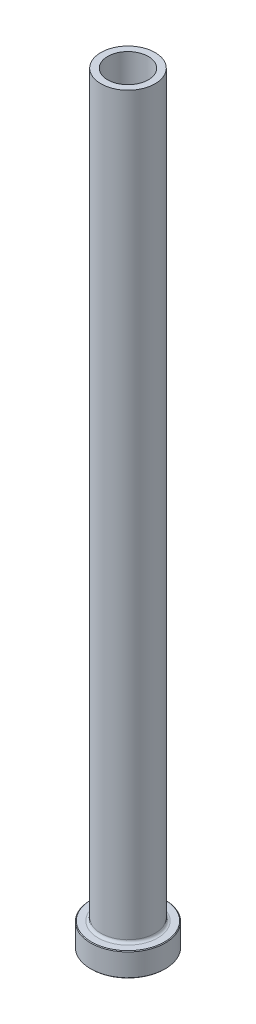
ISO-10303-21;
HEADER;
FILE_DESCRIPTION(('STEP AP214'),'2;1');
FILE_NAME('part.step','',(''),(''),'','','');
FILE_SCHEMA(('AUTOMOTIVE_DESIGN { 1 0 10303 214 1 1 1 1 }'));
ENDSEC;
DATA;
#1=APPLICATION_CONTEXT('core data for automotive mechanical design processes');
#2=APPLICATION_PROTOCOL_DEFINITION('international standard','automotive_design',2000,#1);
#3=PRODUCT_CONTEXT('',#1,'mechanical');
#4=PRODUCT('Part','Part','',(#3));
#5=PRODUCT_RELATED_PRODUCT_CATEGORY('part','',(#4));
#6=PRODUCT_DEFINITION_FORMATION('','',#4);
#7=PRODUCT_DEFINITION_CONTEXT('part definition',#1,'design');
#8=PRODUCT_DEFINITION('design','',#6,#7);
#9=PRODUCT_DEFINITION_SHAPE('','',#8);
#10=(LENGTH_UNIT() NAMED_UNIT(*) SI_UNIT(.MILLI.,.METRE.));
#11=(NAMED_UNIT(*) PLANE_ANGLE_UNIT() SI_UNIT($,.RADIAN.));
#12=(NAMED_UNIT(*) SI_UNIT($,.STERADIAN.) SOLID_ANGLE_UNIT());
#13=UNCERTAINTY_MEASURE_WITH_UNIT(LENGTH_MEASURE(1.E-05),#10,'distance_accuracy_value','');
#14=(GEOMETRIC_REPRESENTATION_CONTEXT(3) GLOBAL_UNCERTAINTY_ASSIGNED_CONTEXT((#13)) GLOBAL_UNIT_ASSIGNED_CONTEXT((#10,
#11,#12)) REPRESENTATION_CONTEXT('',''));
#15=CARTESIAN_POINT('',(0.,0.,0.));
#16=DIRECTION('',(0.,0.,1.));
#17=DIRECTION('',(1.,0.,0.));
#18=AXIS2_PLACEMENT_3D('',#15,#16,#17);
#19=CARTESIAN_POINT('',(0.,92.1876809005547,0.));
#20=DIRECTION('',(0.,1.,0.));
#21=DIRECTION('',(0.,0.,1.));
#22=AXIS2_PLACEMENT_3D('',#19,#20,#21);
#23=CYLINDRICAL_SURFACE('',#22,6.00000000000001);
#24=CARTESIAN_POINT('',(0.,225.,0.));
#25=DIRECTION('',(0.,1.,0.));
#26=DIRECTION('',(0.,0.,1.));
#27=AXIS2_PLACEMENT_3D('',#24,#25,#26);
#28=CIRCLE('',#27,6.00000000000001);
#29=CARTESIAN_POINT('',(0.,225.,6.00000000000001));
#30=VERTEX_POINT('',#29);
#31=EDGE_CURVE('E62',#30,#30,#28,.T.);
#32=ORIENTED_EDGE('',*,*,#31,.T.);
#33=EDGE_LOOP('',(#32));
#34=FACE_BOUND('',#33,.T.);
#35=CARTESIAN_POINT('',(0.,170.,0.));
#36=DIRECTION('',(0.,1.,0.));
#37=DIRECTION('',(0.,0.,1.));
#38=AXIS2_PLACEMENT_3D('',#35,#36,#37);
#39=CIRCLE('',#38,6.00000000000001);
#40=CARTESIAN_POINT('',(0.,170.,6.00000000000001));
#41=VERTEX_POINT('',#40);
#42=EDGE_CURVE('E71',#41,#41,#39,.T.);
#43=ORIENTED_EDGE('',*,*,#42,.F.);
#44=EDGE_LOOP('',(#43));
#45=FACE_BOUND('',#44,.T.);
#46=ADVANCED_FACE('F30',(#34,#45),#23,.F.);
#47=CARTESIAN_POINT('',(-6.00000000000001,225.,0.));
#48=DIRECTION('',(0.,1.,0.));
#49=DIRECTION('',(0.,0.,1.));
#50=AXIS2_PLACEMENT_3D('',#47,#48,#49);
#51=PLANE('',#50);
#52=CARTESIAN_POINT('',(0.,225.,0.));
#53=DIRECTION('',(0.,1.,0.));
#54=DIRECTION('',(0.,0.,1.));
#55=AXIS2_PLACEMENT_3D('',#52,#53,#54);
#56=CIRCLE('',#55,8.00000000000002);
#57=CARTESIAN_POINT('',(0.,225.,8.00000000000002));
#58=VERTEX_POINT('',#57);
#59=EDGE_CURVE('E65',#58,#58,#56,.T.);
#60=ORIENTED_EDGE('',*,*,#59,.T.);
#61=EDGE_LOOP('',(#60));
#62=FACE_BOUND('',#61,.T.);
#63=ORIENTED_EDGE('',*,*,#31,.F.);
#64=EDGE_LOOP('',(#63));
#65=FACE_BOUND('',#64,.T.);
#66=ADVANCED_FACE('F79',(#62,#65),#51,.T.);
#67=CARTESIAN_POINT('',(0.,92.1876809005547,0.));
#68=DIRECTION('',(0.,1.,0.));
#69=DIRECTION('',(0.,0.,1.));
#70=AXIS2_PLACEMENT_3D('',#67,#68,#69);
#71=CYLINDRICAL_SURFACE('',#70,8.);
#72=CARTESIAN_POINT('',(0.,7.8,0.));
#73=DIRECTION('',(0.,1.,0.));
#74=DIRECTION('',(0.,0.,1.));
#75=AXIS2_PLACEMENT_3D('',#72,#73,#74);
#76=CIRCLE('',#75,8.);
#77=CARTESIAN_POINT('',(0.,7.8,8.));
#78=VERTEX_POINT('',#77);
#79=EDGE_CURVE('E59',#78,#78,#76,.T.);
#80=ORIENTED_EDGE('',*,*,#79,.T.);
#81=EDGE_LOOP('',(#80));
#82=FACE_BOUND('',#81,.T.);
#83=ORIENTED_EDGE('',*,*,#59,.F.);
#84=EDGE_LOOP('',(#83));
#85=FACE_BOUND('',#84,.T.);
#86=ADVANCED_FACE('F85',(#82,#85),#71,.T.);
#87=CARTESIAN_POINT('',(-7.99999999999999,7.,0.));
#88=DIRECTION('',(0.,1.,0.));
#89=DIRECTION('',(0.,0.,1.));
#90=AXIS2_PLACEMENT_3D('',#87,#88,#89);
#91=PLANE('',#90);
#92=CARTESIAN_POINT('',(0.,7.,0.));
#93=DIRECTION('',(0.,1.,0.));
#94=DIRECTION('',(0.,0.,1.));
#95=AXIS2_PLACEMENT_3D('',#92,#93,#94);
#96=CIRCLE('',#95,10.8);
#97=CARTESIAN_POINT('',(0.,7.,10.8));
#98=VERTEX_POINT('',#97);
#99=EDGE_CURVE('E53',#98,#98,#96,.T.);
#100=ORIENTED_EDGE('',*,*,#99,.T.);
#101=EDGE_LOOP('',(#100));
#102=FACE_BOUND('',#101,.T.);
#103=CARTESIAN_POINT('',(0.,7.,0.));
#104=DIRECTION('',(0.,1.,0.));
#105=DIRECTION('',(0.,0.,1.));
#106=AXIS2_PLACEMENT_3D('',#103,#104,#105);
#107=CIRCLE('',#106,8.8);
#108=CARTESIAN_POINT('',(0.,7.,8.8));
#109=VERTEX_POINT('',#108);
#110=EDGE_CURVE('E56',#109,#109,#107,.F.);
#111=ORIENTED_EDGE('',*,*,#110,.T.);
#112=EDGE_LOOP('',(#111));
#113=FACE_BOUND('',#112,.T.);
#114=ADVANCED_FACE('F111',(#102,#113),#91,.T.);
#115=CARTESIAN_POINT('',(0.,92.1876809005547,0.));
#116=DIRECTION('',(0.,1.,0.));
#117=DIRECTION('',(0.,0.,1.));
#118=AXIS2_PLACEMENT_3D('',#115,#116,#117);
#119=CYLINDRICAL_SURFACE('',#118,11.);
#120=CARTESIAN_POINT('',(0.,6.79999999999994,0.));
#121=DIRECTION('',(0.,1.,0.));
#122=DIRECTION('',(0.,0.,1.));
#123=AXIS2_PLACEMENT_3D('',#120,#121,#122);
#124=CIRCLE('',#123,11.);
#125=CARTESIAN_POINT('',(0.,6.79999999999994,11.));
#126=VERTEX_POINT('',#125);
#127=EDGE_CURVE('E45',#126,#126,#124,.F.);
#128=ORIENTED_EDGE('',*,*,#127,.T.);
#129=EDGE_LOOP('',(#128));
#130=FACE_BOUND('',#129,.T.);
#131=CARTESIAN_POINT('',(0.,0.19999999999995,0.));
#132=DIRECTION('',(0.,-1.,0.));
#133=DIRECTION('',(0.,0.,-1.));
#134=AXIS2_PLACEMENT_3D('',#131,#132,#133);
#135=CIRCLE('',#134,11.);
#136=CARTESIAN_POINT('',(0.,0.19999999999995,11.));
#137=VERTEX_POINT('',#136);
#138=EDGE_CURVE('E50',#137,#137,#135,.F.);
#139=ORIENTED_EDGE('',*,*,#138,.T.);
#140=EDGE_LOOP('',(#139));
#141=FACE_BOUND('',#140,.T.);
#142=ADVANCED_FACE('F108',(#130,#141),#119,.T.);
#143=CARTESIAN_POINT('',(-11.,0.,0.));
#144=DIRECTION('',(0.,-1.,0.));
#145=DIRECTION('',(0.,0.,-1.));
#146=AXIS2_PLACEMENT_3D('',#143,#144,#145);
#147=PLANE('',#146);
#148=CARTESIAN_POINT('',(0.,0.,0.));
#149=DIRECTION('',(0.,-1.,0.));
#150=DIRECTION('',(0.,0.,-1.));
#151=AXIS2_PLACEMENT_3D('',#148,#149,#150);
#152=CIRCLE('',#151,6.74999999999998);
#153=CARTESIAN_POINT('',(0.,0.,-6.74999999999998));
#154=VERTEX_POINT('',#153);
#155=EDGE_CURVE('E37',#154,#154,#152,.F.);
#156=ORIENTED_EDGE('',*,*,#155,.T.);
#157=EDGE_LOOP('',(#156));
#158=FACE_BOUND('',#157,.T.);
#159=CARTESIAN_POINT('',(0.,0.,0.));
#160=DIRECTION('',(0.,-1.,0.));
#161=DIRECTION('',(0.,0.,-1.));
#162=AXIS2_PLACEMENT_3D('',#159,#160,#161);
#163=CIRCLE('',#162,10.8);
#164=CARTESIAN_POINT('',(0.,0.,10.8));
#165=VERTEX_POINT('',#164);
#166=EDGE_CURVE('E41',#165,#165,#163,.T.);
#167=ORIENTED_EDGE('',*,*,#166,.T.);
#168=EDGE_LOOP('',(#167));
#169=FACE_BOUND('',#168,.T.);
#170=ADVANCED_FACE('F110',(#158,#169),#147,.T.);
#171=CARTESIAN_POINT('',(0.,92.1876809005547,0.));
#172=DIRECTION('',(0.,1.,0.));
#173=DIRECTION('',(0.,0.,1.));
#174=AXIS2_PLACEMENT_3D('',#171,#172,#173);
#175=CYLINDRICAL_SURFACE('',#174,6.25);
#176=CARTESIAN_POINT('',(0.,0.499999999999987,0.));
#177=DIRECTION('',(0.,-1.,0.));
#178=DIRECTION('',(0.,0.,-1.));
#179=AXIS2_PLACEMENT_3D('',#176,#177,#178);
#180=CIRCLE('',#179,6.25);
#181=CARTESIAN_POINT('',(0.,0.499999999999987,-6.25));
#182=VERTEX_POINT('',#181);
#183=EDGE_CURVE('E10',#182,#182,#180,.T.);
#184=ORIENTED_EDGE('',*,*,#183,.T.);
#185=EDGE_LOOP('',(#184));
#186=FACE_BOUND('',#185,.T.);
#187=CARTESIAN_POINT('',(0.,158.,0.));
#188=DIRECTION('',(0.,1.,0.));
#189=DIRECTION('',(0.,0.,1.));
#190=AXIS2_PLACEMENT_3D('',#187,#188,#189);
#191=CIRCLE('',#190,6.25000000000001);
#192=CARTESIAN_POINT('',(0.,158.,6.25000000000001));
#193=VERTEX_POINT('',#192);
#194=EDGE_CURVE('E68',#193,#193,#191,.T.);
#195=ORIENTED_EDGE('',*,*,#194,.T.);
#196=EDGE_LOOP('',(#195));
#197=FACE_BOUND('',#196,.T.);
#198=ADVANCED_FACE('F118',(#186,#197),#175,.F.);
#199=CARTESIAN_POINT('',(0.,158.,0.));
#200=DIRECTION('',(0.,-1.,0.));
#201=DIRECTION('',(0.,0.,-1.));
#202=AXIS2_PLACEMENT_3D('',#199,#200,#201);
#203=CONICAL_SURFACE('',#202,6.25000000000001,0.0208303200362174);
#204=ORIENTED_EDGE('',*,*,#42,.T.);
#205=EDGE_LOOP('',(#204));
#206=FACE_BOUND('',#205,.T.);
#207=ORIENTED_EDGE('',*,*,#194,.F.);
#208=EDGE_LOOP('',(#207));
#209=FACE_BOUND('',#208,.T.);
#210=ADVANCED_FACE('F75',(#206,#209),#203,.F.);
#211=CARTESIAN_POINT('',(0.,7.8,0.));
#212=DIRECTION('',(0.,1.,0.));
#213=DIRECTION('',(0.,0.,1.));
#214=AXIS2_PLACEMENT_3D('',#211,#212,#213);
#215=TOROIDAL_SURFACE('',#214,8.8,0.8);
#216=ORIENTED_EDGE('',*,*,#110,.F.);
#217=EDGE_LOOP('',(#216));
#218=FACE_BOUND('',#217,.T.);
#219=ORIENTED_EDGE('',*,*,#79,.F.);
#220=EDGE_LOOP('',(#219));
#221=FACE_BOUND('',#220,.T.);
#222=ADVANCED_FACE('F90',(#218,#221),#215,.F.);
#223=CARTESIAN_POINT('',(0.,7.00000000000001,0.));
#224=DIRECTION('',(0.,-1.,0.));
#225=DIRECTION('',(0.,0.,-1.));
#226=AXIS2_PLACEMENT_3D('',#223,#224,#225);
#227=CONICAL_SURFACE('',#226,10.7999999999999,0.785398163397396);
#228=ORIENTED_EDGE('',*,*,#127,.F.);
#229=EDGE_LOOP('',(#228));
#230=FACE_BOUND('',#229,.T.);
#231=ORIENTED_EDGE('',*,*,#99,.F.);
#232=EDGE_LOOP('',(#231));
#233=FACE_BOUND('',#232,.T.);
#234=ADVANCED_FACE('F93',(#230,#233),#227,.T.);
#235=CARTESIAN_POINT('',(0.,0.19999999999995,0.));
#236=DIRECTION('',(0.,1.,0.));
#237=DIRECTION('',(0.,0.,1.));
#238=AXIS2_PLACEMENT_3D('',#235,#236,#237);
#239=CONICAL_SURFACE('',#238,11.,0.785398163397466);
#240=CARTESIAN_POINT('',(0.,0.,10.8));
#241=CARTESIAN_POINT('',(0.,0.00208333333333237,10.8020833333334));
#242=CARTESIAN_POINT('',(0.,0.00416666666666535,10.8041666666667));
#243=CARTESIAN_POINT('',(0.,0.0083333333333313,10.8083333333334));
#244=CARTESIAN_POINT('',(0.,0.0104166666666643,10.8104166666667));
#245=CARTESIAN_POINT('',(0.,0.0145833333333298,10.8145833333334));
#246=CARTESIAN_POINT('',(0.,0.0166666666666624,10.8166666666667));
#247=CARTESIAN_POINT('',(0.,0.020833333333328,10.8208333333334));
#248=CARTESIAN_POINT('',(0.,0.0229166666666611,10.8229166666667));
#249=CARTESIAN_POINT('',(0.,0.0270833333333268,10.8270833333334));
#250=CARTESIAN_POINT('',(0.,0.0291666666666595,10.8291666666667));
#251=CARTESIAN_POINT('',(0.,0.033333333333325,10.8333333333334));
#252=CARTESIAN_POINT('',(0.,0.0354166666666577,10.8354166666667));
#253=CARTESIAN_POINT('',(0.,0.0395833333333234,10.8395833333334));
#254=CARTESIAN_POINT('',(0.,0.0416666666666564,10.8416666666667));
#255=CARTESIAN_POINT('',(0.,0.0458333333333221,10.8458333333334));
#256=CARTESIAN_POINT('',(0.,0.0479166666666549,10.8479166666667));
#257=CARTESIAN_POINT('',(0.,0.0520833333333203,10.8520833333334));
#258=CARTESIAN_POINT('',(0.,0.054166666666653,10.8541666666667));
#259=CARTESIAN_POINT('',(0.,0.0583333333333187,10.8583333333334));
#260=CARTESIAN_POINT('',(0.,0.0604166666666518,10.8604166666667));
#261=CARTESIAN_POINT('',(0.,0.0645833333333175,10.8645833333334));
#262=CARTESIAN_POINT('',(0.,0.0666666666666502,10.8666666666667));
#263=CARTESIAN_POINT('',(0.,0.0708333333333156,10.8708333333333));
#264=CARTESIAN_POINT('',(0.,0.0729166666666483,10.8729166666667));
#265=CARTESIAN_POINT('',(0.,0.0770833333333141,10.8770833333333));
#266=CARTESIAN_POINT('',(0.,0.0791666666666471,10.8791666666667));
#267=CARTESIAN_POINT('',(0.,0.0833333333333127,10.8833333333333));
#268=CARTESIAN_POINT('',(0.,0.0854166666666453,10.8854166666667));
#269=CARTESIAN_POINT('',(0.,0.0895833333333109,10.8895833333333));
#270=CARTESIAN_POINT('',(0.,0.0916666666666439,10.8916666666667));
#271=CARTESIAN_POINT('',(0.,0.0958333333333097,10.8958333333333));
#272=CARTESIAN_POINT('',(0.,0.0979166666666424,10.8979166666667));
#273=CARTESIAN_POINT('',(0.,0.102083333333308,10.9020833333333));
#274=CARTESIAN_POINT('',(0.,0.104166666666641,10.9041666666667));
#275=CARTESIAN_POINT('',(0.,0.108333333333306,10.9083333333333));
#276=CARTESIAN_POINT('',(0.,0.110416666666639,10.9104166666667));
#277=CARTESIAN_POINT('',(0.,0.114583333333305,10.9145833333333));
#278=CARTESIAN_POINT('',(0.,0.116666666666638,10.9166666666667));
#279=CARTESIAN_POINT('',(0.,0.120833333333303,10.9208333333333));
#280=CARTESIAN_POINT('',(0.,0.122916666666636,10.9229166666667));
#281=CARTESIAN_POINT('',(0.,0.127083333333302,10.9270833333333));
#282=CARTESIAN_POINT('',(0.,0.129166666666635,10.9291666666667));
#283=CARTESIAN_POINT('',(0.,0.1333333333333,10.9333333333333));
#284=CARTESIAN_POINT('',(0.,0.135416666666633,10.9354166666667));
#285=CARTESIAN_POINT('',(0.,0.139583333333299,10.9395833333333));
#286=CARTESIAN_POINT('',(0.,0.141666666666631,10.9416666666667));
#287=CARTESIAN_POINT('',(0.,0.145833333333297,10.9458333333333));
#288=CARTESIAN_POINT('',(0.,0.14791666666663,10.9479166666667));
#289=CARTESIAN_POINT('',(0.,0.152083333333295,10.9520833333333));
#290=CARTESIAN_POINT('',(0.,0.154166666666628,10.9541666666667));
#291=CARTESIAN_POINT('',(0.,0.158333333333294,10.9583333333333));
#292=CARTESIAN_POINT('',(0.,0.160416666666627,10.9604166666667));
#293=CARTESIAN_POINT('',(0.,0.164583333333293,10.9645833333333));
#294=CARTESIAN_POINT('',(0.,0.166666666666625,10.9666666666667));
#295=CARTESIAN_POINT('',(0.,0.170833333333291,10.9708333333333));
#296=CARTESIAN_POINT('',(0.,0.172916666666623,10.9729166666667));
#297=CARTESIAN_POINT('',(0.,0.177083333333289,10.9770833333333));
#298=CARTESIAN_POINT('',(0.,0.179166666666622,10.9791666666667));
#299=CARTESIAN_POINT('',(0.,0.183333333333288,10.9833333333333));
#300=CARTESIAN_POINT('',(0.,0.18541666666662,10.9854166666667));
#301=CARTESIAN_POINT('',(0.,0.189583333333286,10.9895833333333));
#302=CARTESIAN_POINT('',(0.,0.191666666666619,10.9916666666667));
#303=CARTESIAN_POINT('',(0.,0.195833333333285,10.9958333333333));
#304=CARTESIAN_POINT('',(0.,0.197916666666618,10.9979166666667));
#305=CARTESIAN_POINT('',(0.,0.19999999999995,11.));
#306=B_SPLINE_CURVE_WITH_KNOTS('',3,(#240,#241,#242,#243,#244,#245,#246,#247,#248,#249,#250,
#251,#252,#253,#254,#255,#256,#257,#258,#259,#260,#261,#262,#263,#264,#265,#266,#267,#268,#269,
#270,#271,#272,#273,#274,#275,#276,#277,#278,#279,#280,#281,#282,#283,#284,#285,#286,#287,#288,
#289,#290,#291,#292,#293,#294,#295,#296,#297,#298,#299,#300,#301,#302,#303,#304,#305),
.UNSPECIFIED.,.F.,.F.,(4,2,2,2,2,2,2,2,2,2,2,2,2,2,2,2,2,2,2,2,2,2,2,2,2,2,2,2,2,2,2,2,4),(0.,
0.00883883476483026,0.0176776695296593,0.0265165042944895,0.0353553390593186,0.0441941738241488,
0.0530330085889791,0.0618718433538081,0.0707106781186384,0.0795495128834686,0.0883883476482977,
0.0972271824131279,0.106066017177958,0.114904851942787,0.123743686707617,0.132582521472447,
0.141421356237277,0.150260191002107,0.159099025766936,0.167937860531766,0.176776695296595,
0.185615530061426,0.194454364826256,0.203293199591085,0.212132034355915,0.220970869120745,
0.229809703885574,0.238648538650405,0.247487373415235,0.256326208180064,0.265165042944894,
0.274003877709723,0.282842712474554),.UNSPECIFIED.);
#307=EDGE_CURVE('BSEAM96',#165,#137,#306,.T.);
#308=ORIENTED_EDGE('',*,*,#166,.F.);
#309=ORIENTED_EDGE('',*,*,#138,.F.);
#310=ORIENTED_EDGE('',*,*,#307,.T.);
#311=ORIENTED_EDGE('',*,*,#307,.F.);
#312=EDGE_LOOP('',(#308,#310,#309,#311));
#313=FACE_BOUND('',#312,.T.);
#314=ADVANCED_FACE('F96',(#313),#239,.T.);
#315=CARTESIAN_POINT('',(0.,0.,0.));
#316=DIRECTION('',(0.,-1.,0.));
#317=DIRECTION('',(0.,0.,-1.));
#318=AXIS2_PLACEMENT_3D('',#315,#316,#317);
#319=CONICAL_SURFACE('',#318,6.74999999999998,0.78539816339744);
#320=ORIENTED_EDGE('',*,*,#183,.F.);
#321=EDGE_LOOP('',(#320));
#322=FACE_BOUND('',#321,.T.);
#323=ORIENTED_EDGE('',*,*,#155,.F.);
#324=EDGE_LOOP('',(#323));
#325=FACE_BOUND('',#324,.T.);
#326=ADVANCED_FACE('F32',(#322,#325),#319,.F.);
#327=CLOSED_SHELL('',(#46,#66,#86,#114,#142,#170,#198,#210,#222,#234,#314,#326));
#328=MANIFOLD_SOLID_BREP('B2',#327);
#329=ADVANCED_BREP_SHAPE_REPRESENTATION('',(#18,#328),#14);
#330=SHAPE_DEFINITION_REPRESENTATION(#9,#329);
ENDSEC;
END-ISO-10303-21;
